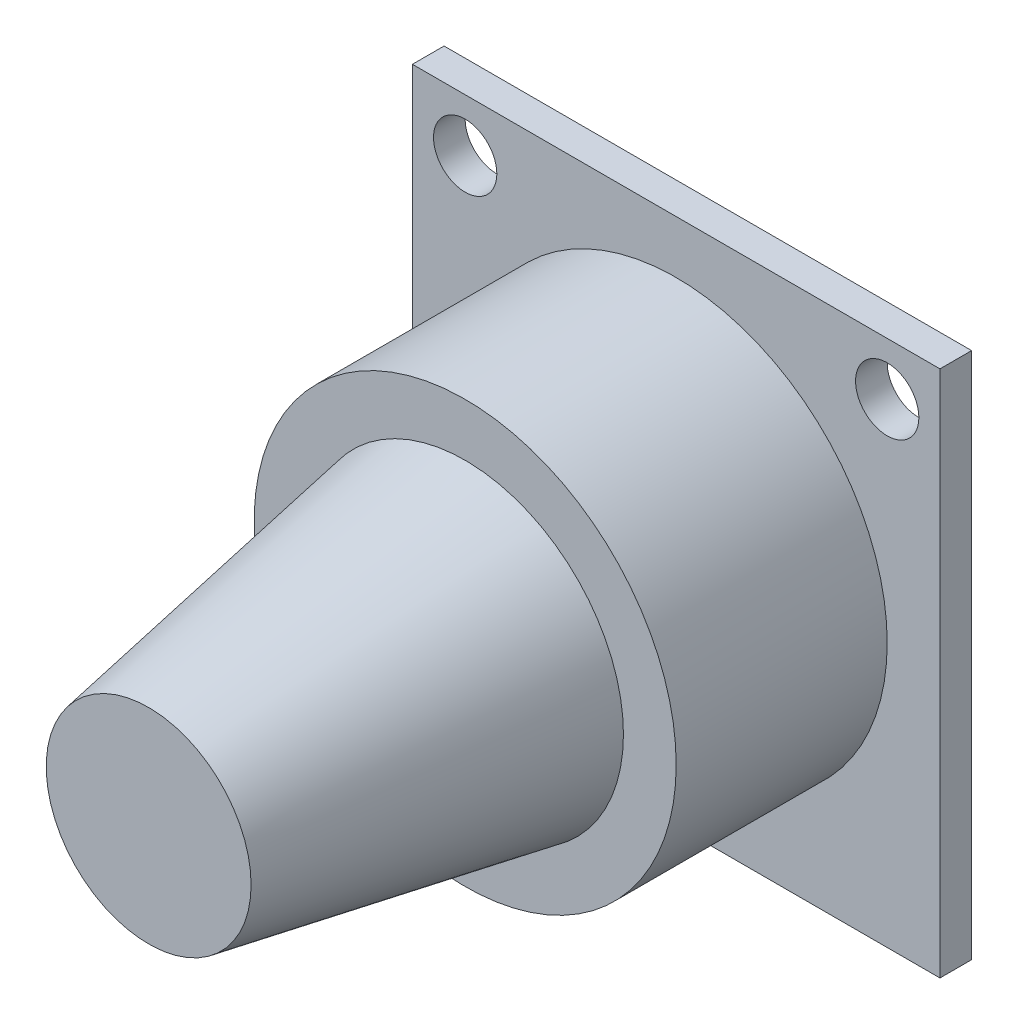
from build123d import *

# Parameters (mm, degrees)
SKETCH1_W           = 50
SKETCH1_H           = 50
BOSS_EXTRUDE1_DEPTH = 3
SKETCH2_R           = 20
BOSS_EXTRUDE2_DEPTH = 20
SKETCH3_R           = 15
BOSS_EXTRUDE3_DEPTH = 30
BOSS_EXTRUDE3_TAPER = 10
CUT_EXTRUDE2_REACH  = 63.237
SKETCH6_R           = 3
SKETCH5_R           = 1.5
CUT_EXTRUDE3_DEPTH  = 10
SKETCH8_R           = 12.5
CUT_EXTRUDE4_DEPTH  = 10


with BuildPart() as part:
    # Sketch1 → Boss-Extrude1 (new body)
    with BuildSketch(Plane.XY):
        Rectangle(SKETCH1_W, SKETCH1_H)
    extrude(amount=BOSS_EXTRUDE1_DEPTH)

    # Sketch2 → Boss-Extrude2 (add)
    with BuildSketch(Plane.XY.offset(3)):
        Circle(SKETCH2_R)
    extrude(amount=BOSS_EXTRUDE2_DEPTH)

    # Sketch3 → Boss-Extrude3 (add)
    with BuildSketch(Plane.XY.offset(23)):
        Circle(SKETCH3_R)
    extrude(amount=BOSS_EXTRUDE3_DEPTH, taper=BOSS_EXTRUDE3_TAPER)

    # Sketch6 → Cut-Extrude2 (cut, up to next)
    with BuildSketch(Plane.XY.offset(3), mode=Mode.PRIVATE) as cut_extrude2_sk1:
        with Locations((-20, 20)):
            Circle(SKETCH6_R)
    cut_extrude2_tool1 = extrude(cut_extrude2_sk1.sketch, amount=-CUT_EXTRUDE2_REACH, mode=Mode.PRIVATE) & part.part
    # Sketch6 → Cut-Extrude2 (cut, up to next)
    with BuildSketch(Plane.XY.offset(3), mode=Mode.PRIVATE) as cut_extrude2_sk2:
        with Locations((20, 20)):
            Circle(SKETCH6_R)
    cut_extrude2_tool2 = extrude(cut_extrude2_sk2.sketch, amount=-CUT_EXTRUDE2_REACH, mode=Mode.PRIVATE) & part.part
    add(cut_extrude2_tool1.solids().sort_by_distance((-20, 20, 3))[0], mode=Mode.SUBTRACT)
    add(cut_extrude2_tool2.solids().sort_by_distance((20, 20, 3))[0], mode=Mode.SUBTRACT)

    # Sketch5 → Cut-Extrude3 (cut)
    with BuildSketch(Plane(origin=(0, 0, 0), x_dir=(-1, 0, 0), z_dir=(0, 0, -1))):
        with Locations((-10, 0)):
            Circle(SKETCH5_R)
        with Locations((10, 0)):
            Circle(SKETCH5_R)
        with Locations((0, 10)):
            Circle(SKETCH5_R)
        with Locations((0, -10)):
            Circle(SKETCH5_R)
    extrude(amount=-CUT_EXTRUDE3_DEPTH, mode=Mode.SUBTRACT)

    # Sketch8 → Cut-Extrude4 (cut)
    with BuildSketch(Plane(origin=(0, 0, 0), x_dir=(-1, 0, 0), z_dir=(0, 0, -1))):
        Circle(SKETCH8_R)
    extrude(amount=-CUT_EXTRUDE4_DEPTH, mode=Mode.SUBTRACT)


solid = part.part
